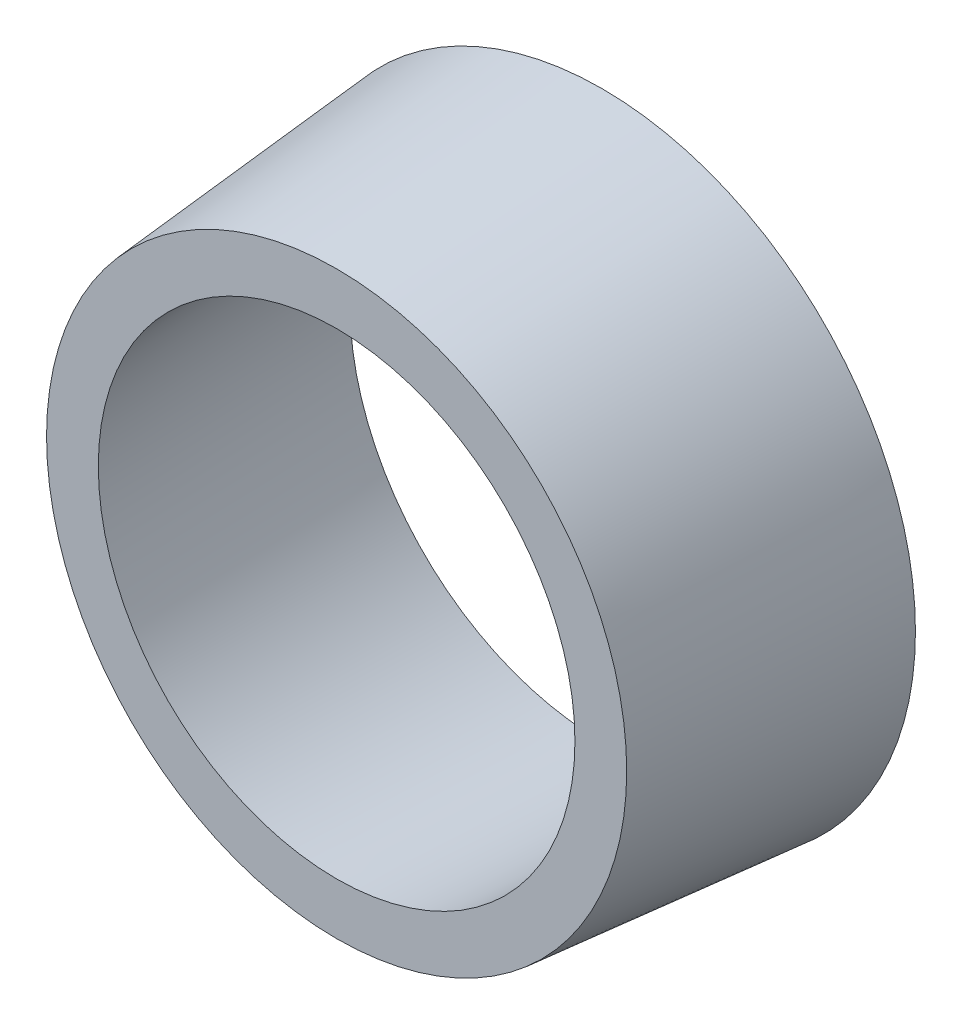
ISO-10303-21;
HEADER;
FILE_DESCRIPTION(('STEP AP214'),'2;1');
FILE_NAME('part.step','',(''),(''),'','','');
FILE_SCHEMA(('AUTOMOTIVE_DESIGN { 1 0 10303 214 1 1 1 1 }'));
ENDSEC;
DATA;
#1=APPLICATION_CONTEXT('core data for automotive mechanical design processes');
#2=APPLICATION_PROTOCOL_DEFINITION('international standard','automotive_design',2000,#1);
#3=PRODUCT_CONTEXT('',#1,'mechanical');
#4=PRODUCT('Part','Part','',(#3));
#5=PRODUCT_RELATED_PRODUCT_CATEGORY('part','',(#4));
#6=PRODUCT_DEFINITION_FORMATION('','',#4);
#7=PRODUCT_DEFINITION_CONTEXT('part definition',#1,'design');
#8=PRODUCT_DEFINITION('design','',#6,#7);
#9=PRODUCT_DEFINITION_SHAPE('','',#8);
#10=(LENGTH_UNIT() NAMED_UNIT(*) SI_UNIT(.MILLI.,.METRE.));
#11=(NAMED_UNIT(*) PLANE_ANGLE_UNIT() SI_UNIT($,.RADIAN.));
#12=(NAMED_UNIT(*) SI_UNIT($,.STERADIAN.) SOLID_ANGLE_UNIT());
#13=UNCERTAINTY_MEASURE_WITH_UNIT(LENGTH_MEASURE(1.E-05),#10,'distance_accuracy_value','');
#14=(GEOMETRIC_REPRESENTATION_CONTEXT(3) GLOBAL_UNCERTAINTY_ASSIGNED_CONTEXT((#13)) GLOBAL_UNIT_ASSIGNED_CONTEXT((#10,
#11,#12)) REPRESENTATION_CONTEXT('',''));
#15=CARTESIAN_POINT('',(0.,0.,0.));
#16=DIRECTION('',(0.,0.,1.));
#17=DIRECTION('',(1.,0.,0.));
#18=AXIS2_PLACEMENT_3D('',#15,#16,#17);
#19=CARTESIAN_POINT('',(0.,0.,0.));
#20=DIRECTION('',(0.,0.,-1.));
#21=DIRECTION('',(1.,0.,0.));
#22=AXIS2_PLACEMENT_3D('',#19,#20,#21);
#23=CONICAL_SURFACE('',#22,5.9,0.0872664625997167);
#24=CARTESIAN_POINT('',(0.,0.,5.));
#25=DIRECTION('',(0.,0.,1.));
#26=DIRECTION('',(1.,0.,0.));
#27=AXIS2_PLACEMENT_3D('',#24,#25,#26);
#28=CIRCLE('',#27,5.46255668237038);
#29=CARTESIAN_POINT('',(5.46255668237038,0.,5.));
#30=VERTEX_POINT('',#29);
#31=EDGE_CURVE('E10',#30,#30,#28,.T.);
#32=ORIENTED_EDGE('',*,*,#31,.F.);
#33=EDGE_LOOP('',(#32));
#34=FACE_BOUND('',#33,.T.);
#35=CARTESIAN_POINT('',(0.,0.,0.));
#36=DIRECTION('',(0.,0.,1.));
#37=DIRECTION('',(1.,0.,0.));
#38=AXIS2_PLACEMENT_3D('',#35,#36,#37);
#39=CIRCLE('',#38,5.9);
#40=CARTESIAN_POINT('',(5.9,0.,0.));
#41=VERTEX_POINT('',#40);
#42=EDGE_CURVE('E44',#41,#41,#39,.T.);
#43=ORIENTED_EDGE('',*,*,#42,.T.);
#44=EDGE_LOOP('',(#43));
#45=FACE_BOUND('',#44,.T.);
#46=ADVANCED_FACE('F37',(#34,#45),#23,.T.);
#47=CARTESIAN_POINT('',(0.,0.,5.));
#48=DIRECTION('',(0.,0.,1.));
#49=DIRECTION('',(1.,0.,0.));
#50=AXIS2_PLACEMENT_3D('',#47,#48,#49);
#51=PLANE('',#50);
#52=CARTESIAN_POINT('',(0.,0.,5.));
#53=DIRECTION('',(0.,0.,1.));
#54=DIRECTION('',(1.,0.,0.));
#55=AXIS2_PLACEMENT_3D('',#52,#53,#54);
#56=CIRCLE('',#55,4.48796110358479);
#57=CARTESIAN_POINT('',(4.48796110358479,0.,5.));
#58=VERTEX_POINT('',#57);
#59=EDGE_CURVE('E49',#58,#58,#56,.T.);
#60=ORIENTED_EDGE('',*,*,#59,.F.);
#61=EDGE_LOOP('',(#60));
#62=FACE_BOUND('',#61,.T.);
#63=ORIENTED_EDGE('',*,*,#31,.T.);
#64=EDGE_LOOP('',(#63));
#65=FACE_BOUND('',#64,.T.);
#66=ADVANCED_FACE('F66',(#62,#65),#51,.T.);
#67=CARTESIAN_POINT('',(0.,0.,0.));
#68=DIRECTION('',(0.,0.,1.));
#69=DIRECTION('',(1.,0.,0.));
#70=AXIS2_PLACEMENT_3D('',#67,#68,#69);
#71=PLANE('',#70);
#72=CARTESIAN_POINT('',(0.,0.,0.));
#73=DIRECTION('',(0.,0.,-1.));
#74=DIRECTION('',(-1.,0.,0.));
#75=AXIS2_PLACEMENT_3D('',#72,#73,#74);
#76=CIRCLE('',#75,4.75);
#77=CARTESIAN_POINT('',(-4.75,0.,0.));
#78=VERTEX_POINT('',#77);
#79=EDGE_CURVE('E54',#78,#78,#76,.T.);
#80=ORIENTED_EDGE('',*,*,#79,.F.);
#81=EDGE_LOOP('',(#80));
#82=FACE_BOUND('',#81,.T.);
#83=ORIENTED_EDGE('',*,*,#42,.F.);
#84=EDGE_LOOP('',(#83));
#85=FACE_BOUND('',#84,.T.);
#86=ADVANCED_FACE('F63',(#82,#85),#71,.F.);
#87=CARTESIAN_POINT('',(0.,0.,0.));
#88=DIRECTION('',(0.,0.,-1.));
#89=DIRECTION('',(-1.,0.,0.));
#90=AXIS2_PLACEMENT_3D('',#87,#88,#89);
#91=CONICAL_SURFACE('',#90,4.75,0.05235987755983);
#92=ORIENTED_EDGE('',*,*,#59,.T.);
#93=EDGE_LOOP('',(#92));
#94=FACE_BOUND('',#93,.T.);
#95=ORIENTED_EDGE('',*,*,#79,.T.);
#96=EDGE_LOOP('',(#95));
#97=FACE_BOUND('',#96,.T.);
#98=ADVANCED_FACE('F61',(#94,#97),#91,.F.);
#99=CLOSED_SHELL('',(#46,#66,#86,#98));
#100=MANIFOLD_SOLID_BREP('B2',#99);
#101=ADVANCED_BREP_SHAPE_REPRESENTATION('',(#18,#100),#14);
#102=SHAPE_DEFINITION_REPRESENTATION(#9,#101);
ENDSEC;
END-ISO-10303-21;
